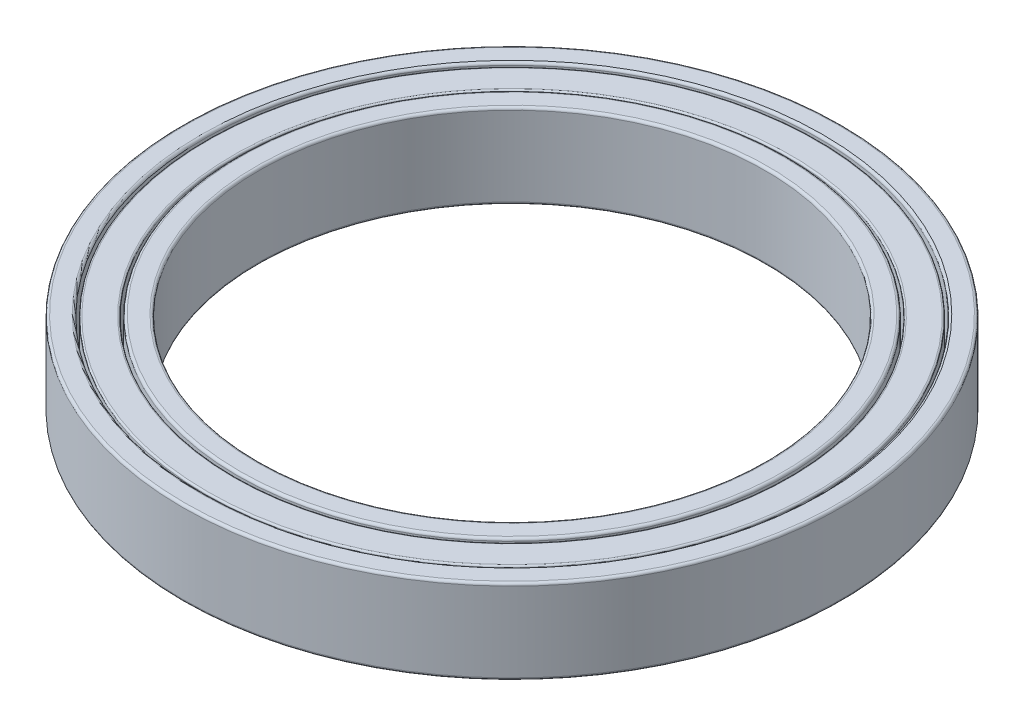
ISO-10303-21;
HEADER;
FILE_DESCRIPTION(('STEP AP214'),'2;1');
FILE_NAME('part.step','',(''),(''),'','','');
FILE_SCHEMA(('AUTOMOTIVE_DESIGN { 1 0 10303 214 1 1 1 1 }'));
ENDSEC;
DATA;
#1=APPLICATION_CONTEXT('core data for automotive mechanical design processes');
#2=APPLICATION_PROTOCOL_DEFINITION('international standard','automotive_design',2000,#1);
#3=PRODUCT_CONTEXT('',#1,'mechanical');
#4=PRODUCT('Part','Part','',(#3));
#5=PRODUCT_RELATED_PRODUCT_CATEGORY('part','',(#4));
#6=PRODUCT_DEFINITION_FORMATION('','',#4);
#7=PRODUCT_DEFINITION_CONTEXT('part definition',#1,'design');
#8=PRODUCT_DEFINITION('design','',#6,#7);
#9=PRODUCT_DEFINITION_SHAPE('','',#8);
#10=(LENGTH_UNIT() NAMED_UNIT(*) SI_UNIT(.MILLI.,.METRE.));
#11=(NAMED_UNIT(*) PLANE_ANGLE_UNIT() SI_UNIT($,.RADIAN.));
#12=(NAMED_UNIT(*) SI_UNIT($,.STERADIAN.) SOLID_ANGLE_UNIT());
#13=UNCERTAINTY_MEASURE_WITH_UNIT(LENGTH_MEASURE(1.E-05),#10,'distance_accuracy_value','');
#14=(GEOMETRIC_REPRESENTATION_CONTEXT(3) GLOBAL_UNCERTAINTY_ASSIGNED_CONTEXT((#13)) GLOBAL_UNIT_ASSIGNED_CONTEXT((#10,
#11,#12)) REPRESENTATION_CONTEXT('',''));
#15=CARTESIAN_POINT('',(0.,0.,0.));
#16=DIRECTION('',(0.,0.,1.));
#17=DIRECTION('',(1.,0.,0.));
#18=AXIS2_PLACEMENT_3D('',#15,#16,#17);
#19=CARTESIAN_POINT('',(0.,-102.389061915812,0.));
#20=DIRECTION('',(0.,1.,0.));
#21=DIRECTION('',(0.,0.,1.));
#22=AXIS2_PLACEMENT_3D('',#19,#20,#21);
#23=CYLINDRICAL_SURFACE('',#22,36.2);
#24=CARTESIAN_POINT('',(0.,0.399999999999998,0.));
#25=DIRECTION('',(0.,1.,0.));
#26=DIRECTION('',(0.,0.,1.));
#27=AXIS2_PLACEMENT_3D('',#24,#25,#26);
#28=CIRCLE('',#27,36.2);
#29=CARTESIAN_POINT('',(0.,0.399999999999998,36.2));
#30=VERTEX_POINT('',#29);
#31=EDGE_CURVE('E70',#30,#30,#28,.T.);
#32=ORIENTED_EDGE('',*,*,#31,.T.);
#33=EDGE_LOOP('',(#32));
#34=FACE_BOUND('',#33,.T.);
#35=CARTESIAN_POINT('',(0.,9.6,0.));
#36=DIRECTION('',(0.,1.,0.));
#37=DIRECTION('',(0.,0.,1.));
#38=AXIS2_PLACEMENT_3D('',#35,#36,#37);
#39=CIRCLE('',#38,36.2);
#40=CARTESIAN_POINT('',(0.,9.6,36.2));
#41=VERTEX_POINT('',#40);
#42=EDGE_CURVE('E74',#41,#41,#39,.F.);
#43=ORIENTED_EDGE('',*,*,#42,.T.);
#44=EDGE_LOOP('',(#43));
#45=FACE_BOUND('',#44,.T.);
#46=ADVANCED_FACE('F59',(#34,#45),#23,.T.);
#47=CARTESIAN_POINT('',(0.,9.8,0.));
#48=DIRECTION('',(0.,1.,0.));
#49=DIRECTION('',(0.,0.,1.));
#50=AXIS2_PLACEMENT_3D('',#47,#48,#49);
#51=PLANE('',#50);
#52=CARTESIAN_POINT('',(0.,9.8,0.));
#53=DIRECTION('',(0.,1.,0.));
#54=DIRECTION('',(0.,0.,1.));
#55=AXIS2_PLACEMENT_3D('',#52,#53,#54);
#56=CIRCLE('',#55,36.);
#57=CARTESIAN_POINT('',(0.,9.8,36.));
#58=VERTEX_POINT('',#57);
#59=EDGE_CURVE('E11',#58,#58,#56,.T.);
#60=ORIENTED_EDGE('',*,*,#59,.T.);
#61=EDGE_LOOP('',(#60));
#62=FACE_BOUND('',#61,.T.);
#63=CARTESIAN_POINT('',(0.,9.8,0.));
#64=DIRECTION('',(0.,1.,0.));
#65=DIRECTION('',(0.,0.,1.));
#66=AXIS2_PLACEMENT_3D('',#63,#64,#65);
#67=CIRCLE('',#66,33.);
#68=CARTESIAN_POINT('',(0.,9.8,33.));
#69=VERTEX_POINT('',#68);
#70=EDGE_CURVE('E66',#69,#69,#67,.F.);
#71=ORIENTED_EDGE('',*,*,#70,.T.);
#72=EDGE_LOOP('',(#71));
#73=FACE_BOUND('',#72,.T.);
#74=ADVANCED_FACE('F103',(#62,#73),#51,.T.);
#75=CARTESIAN_POINT('',(0.,-102.389061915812,0.));
#76=DIRECTION('',(0.,1.,0.));
#77=DIRECTION('',(0.,0.,1.));
#78=AXIS2_PLACEMENT_3D('',#75,#76,#77);
#79=CYLINDRICAL_SURFACE('',#78,32.8);
#80=CARTESIAN_POINT('',(0.,0.399999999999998,0.));
#81=DIRECTION('',(0.,1.,0.));
#82=DIRECTION('',(0.,0.,1.));
#83=AXIS2_PLACEMENT_3D('',#80,#81,#82);
#84=CIRCLE('',#83,32.8);
#85=CARTESIAN_POINT('',(0.,0.399999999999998,32.8));
#86=VERTEX_POINT('',#85);
#87=EDGE_CURVE('E85',#86,#86,#84,.F.);
#88=ORIENTED_EDGE('',*,*,#87,.T.);
#89=EDGE_LOOP('',(#88));
#90=FACE_BOUND('',#89,.T.);
#91=CARTESIAN_POINT('',(0.,9.6,0.));
#92=DIRECTION('',(0.,1.,0.));
#93=DIRECTION('',(0.,0.,1.));
#94=AXIS2_PLACEMENT_3D('',#91,#92,#93);
#95=CIRCLE('',#94,32.8);
#96=CARTESIAN_POINT('',(0.,9.6,32.8));
#97=VERTEX_POINT('',#96);
#98=EDGE_CURVE('E88',#97,#97,#95,.T.);
#99=ORIENTED_EDGE('',*,*,#98,.T.);
#100=EDGE_LOOP('',(#99));
#101=FACE_BOUND('',#100,.T.);
#102=ADVANCED_FACE('F92',(#90,#101),#79,.F.);
#103=CARTESIAN_POINT('',(0.,0.2,0.));
#104=DIRECTION('',(0.,1.,0.));
#105=DIRECTION('',(0.,0.,1.));
#106=AXIS2_PLACEMENT_3D('',#103,#104,#105);
#107=PLANE('',#106);
#108=CARTESIAN_POINT('',(0.,0.2,0.));
#109=DIRECTION('',(0.,1.,0.));
#110=DIRECTION('',(0.,0.,1.));
#111=AXIS2_PLACEMENT_3D('',#108,#109,#110);
#112=CIRCLE('',#111,33.);
#113=CARTESIAN_POINT('',(0.,0.2,33.));
#114=VERTEX_POINT('',#113);
#115=EDGE_CURVE('E79',#114,#114,#112,.T.);
#116=ORIENTED_EDGE('',*,*,#115,.T.);
#117=EDGE_LOOP('',(#116));
#118=FACE_BOUND('',#117,.T.);
#119=CARTESIAN_POINT('',(0.,0.2,0.));
#120=DIRECTION('',(0.,1.,0.));
#121=DIRECTION('',(0.,0.,1.));
#122=AXIS2_PLACEMENT_3D('',#119,#120,#121);
#123=CIRCLE('',#122,36.);
#124=CARTESIAN_POINT('',(0.,0.2,36.));
#125=VERTEX_POINT('',#124);
#126=EDGE_CURVE('E82',#125,#125,#123,.F.);
#127=ORIENTED_EDGE('',*,*,#126,.T.);
#128=EDGE_LOOP('',(#127));
#129=FACE_BOUND('',#128,.T.);
#130=ADVANCED_FACE('F116',(#118,#129),#107,.F.);
#131=CARTESIAN_POINT('',(0.,0.399999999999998,0.));
#132=DIRECTION('',(0.,1.,0.));
#133=DIRECTION('',(0.,0.,1.));
#134=AXIS2_PLACEMENT_3D('',#131,#132,#133);
#135=TOROIDAL_SURFACE('',#134,33.,0.2);
#136=ORIENTED_EDGE('',*,*,#115,.F.);
#137=EDGE_LOOP('',(#136));
#138=FACE_BOUND('',#137,.T.);
#139=ORIENTED_EDGE('',*,*,#87,.F.);
#140=EDGE_LOOP('',(#139));
#141=FACE_BOUND('',#140,.T.);
#142=ADVANCED_FACE('F113',(#138,#141),#135,.T.);
#143=CARTESIAN_POINT('',(0.,0.399999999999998,0.));
#144=DIRECTION('',(0.,1.,0.));
#145=DIRECTION('',(0.,0.,1.));
#146=AXIS2_PLACEMENT_3D('',#143,#144,#145);
#147=TOROIDAL_SURFACE('',#146,36.,0.2);
#148=ORIENTED_EDGE('',*,*,#31,.F.);
#149=EDGE_LOOP('',(#148));
#150=FACE_BOUND('',#149,.T.);
#151=ORIENTED_EDGE('',*,*,#126,.F.);
#152=EDGE_LOOP('',(#151));
#153=FACE_BOUND('',#152,.T.);
#154=ADVANCED_FACE('F100',(#150,#153),#147,.T.);
#155=CARTESIAN_POINT('',(0.,9.6,0.));
#156=DIRECTION('',(0.,1.,0.));
#157=DIRECTION('',(0.,0.,1.));
#158=AXIS2_PLACEMENT_3D('',#155,#156,#157);
#159=TOROIDAL_SURFACE('',#158,36.,0.2);
#160=ORIENTED_EDGE('',*,*,#42,.F.);
#161=EDGE_LOOP('',(#160));
#162=FACE_BOUND('',#161,.T.);
#163=ORIENTED_EDGE('',*,*,#59,.F.);
#164=EDGE_LOOP('',(#163));
#165=FACE_BOUND('',#164,.T.);
#166=ADVANCED_FACE('F95',(#162,#165),#159,.T.);
#167=CARTESIAN_POINT('',(0.,9.6,0.));
#168=DIRECTION('',(0.,1.,0.));
#169=DIRECTION('',(0.,0.,1.));
#170=AXIS2_PLACEMENT_3D('',#167,#168,#169);
#171=TOROIDAL_SURFACE('',#170,33.,0.2);
#172=ORIENTED_EDGE('',*,*,#70,.F.);
#173=EDGE_LOOP('',(#172));
#174=FACE_BOUND('',#173,.T.);
#175=ORIENTED_EDGE('',*,*,#98,.F.);
#176=EDGE_LOOP('',(#175));
#177=FACE_BOUND('',#176,.T.);
#178=ADVANCED_FACE('F61',(#174,#177),#171,.T.);
#179=CLOSED_SHELL('',(#46,#74,#102,#130,#142,#154,#166,#178));
#180=MANIFOLD_SOLID_BREP('B2',#179);
#181=CARTESIAN_POINT('',(0.,120.308657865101,0.));
#182=DIRECTION('',(0.,-1.,0.));
#183=DIRECTION('',(0.,0.,-1.));
#184=AXIS2_PLACEMENT_3D('',#181,#182,#183);
#185=CYLINDRICAL_SURFACE('',#184,39.);
#186=CARTESIAN_POINT('',(0.,0.299999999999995,0.));
#187=DIRECTION('',(0.,1.,0.));
#188=DIRECTION('',(0.,0.,1.));
#189=AXIS2_PLACEMENT_3D('',#186,#187,#188);
#190=CIRCLE('',#189,39.);
#191=CARTESIAN_POINT('',(0.,0.299999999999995,39.));
#192=VERTEX_POINT('',#191);
#193=EDGE_CURVE('E58',#192,#192,#190,.T.);
#194=ORIENTED_EDGE('',*,*,#193,.T.);
#195=EDGE_LOOP('',(#194));
#196=FACE_BOUND('',#195,.T.);
#197=CARTESIAN_POINT('',(0.,9.7,0.));
#198=DIRECTION('',(0.,1.,0.));
#199=DIRECTION('',(0.,0.,1.));
#200=AXIS2_PLACEMENT_3D('',#197,#198,#199);
#201=CIRCLE('',#200,39.);
#202=CARTESIAN_POINT('',(0.,9.7,39.));
#203=VERTEX_POINT('',#202);
#204=EDGE_CURVE('E196',#203,#203,#201,.F.);
#205=ORIENTED_EDGE('',*,*,#204,.T.);
#206=EDGE_LOOP('',(#205));
#207=FACE_BOUND('',#206,.T.);
#208=ADVANCED_FACE('F189',(#196,#207),#185,.T.);
#209=CARTESIAN_POINT('',(0.,0.,0.));
#210=DIRECTION('',(0.,1.,0.));
#211=DIRECTION('',(0.,0.,1.));
#212=AXIS2_PLACEMENT_3D('',#209,#210,#211);
#213=PLANE('',#212);
#214=CARTESIAN_POINT('',(0.,0.,0.));
#215=DIRECTION('',(0.,1.,0.));
#216=DIRECTION('',(0.,0.,1.));
#217=AXIS2_PLACEMENT_3D('',#214,#215,#216);
#218=CIRCLE('',#217,36.8);
#219=CARTESIAN_POINT('',(0.,0.,36.8));
#220=VERTEX_POINT('',#219);
#221=EDGE_CURVE('E215',#220,#220,#218,.T.);
#222=ORIENTED_EDGE('',*,*,#221,.T.);
#223=EDGE_LOOP('',(#222));
#224=FACE_BOUND('',#223,.T.);
#225=CARTESIAN_POINT('',(0.,0.,0.));
#226=DIRECTION('',(0.,1.,0.));
#227=DIRECTION('',(0.,0.,1.));
#228=AXIS2_PLACEMENT_3D('',#225,#226,#227);
#229=CIRCLE('',#228,38.7);
#230=CARTESIAN_POINT('',(0.,0.,38.7));
#231=VERTEX_POINT('',#230);
#232=EDGE_CURVE('E218',#231,#231,#229,.F.);
#233=ORIENTED_EDGE('',*,*,#232,.T.);
#234=EDGE_LOOP('',(#233));
#235=FACE_BOUND('',#234,.T.);
#236=ADVANCED_FACE('F222',(#224,#235),#213,.F.);
#237=CARTESIAN_POINT('',(0.,120.308657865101,0.));
#238=DIRECTION('',(0.,-1.,0.));
#239=DIRECTION('',(0.,0.,-1.));
#240=AXIS2_PLACEMENT_3D('',#237,#238,#239);
#241=CYLINDRICAL_SURFACE('',#240,36.5);
#242=CARTESIAN_POINT('',(0.,0.299999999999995,0.));
#243=DIRECTION('',(0.,1.,0.));
#244=DIRECTION('',(0.,0.,1.));
#245=AXIS2_PLACEMENT_3D('',#242,#243,#244);
#246=CIRCLE('',#245,36.5);
#247=CARTESIAN_POINT('',(0.,0.299999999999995,36.5));
#248=VERTEX_POINT('',#247);
#249=EDGE_CURVE('E209',#248,#248,#246,.F.);
#250=ORIENTED_EDGE('',*,*,#249,.T.);
#251=EDGE_LOOP('',(#250));
#252=FACE_BOUND('',#251,.T.);
#253=CARTESIAN_POINT('',(0.,9.7,0.));
#254=DIRECTION('',(0.,1.,0.));
#255=DIRECTION('',(0.,0.,1.));
#256=AXIS2_PLACEMENT_3D('',#253,#254,#255);
#257=CIRCLE('',#256,36.5);
#258=CARTESIAN_POINT('',(0.,9.7,36.5));
#259=VERTEX_POINT('',#258);
#260=EDGE_CURVE('E212',#259,#259,#257,.T.);
#261=ORIENTED_EDGE('',*,*,#260,.T.);
#262=EDGE_LOOP('',(#261));
#263=FACE_BOUND('',#262,.T.);
#264=ADVANCED_FACE('F241',(#252,#263),#241,.F.);
#265=CARTESIAN_POINT('',(0.,10.,0.));
#266=DIRECTION('',(0.,1.,0.));
#267=DIRECTION('',(0.,0.,1.));
#268=AXIS2_PLACEMENT_3D('',#265,#266,#267);
#269=PLANE('',#268);
#270=CARTESIAN_POINT('',(0.,10.,0.));
#271=DIRECTION('',(0.,1.,0.));
#272=DIRECTION('',(0.,0.,1.));
#273=AXIS2_PLACEMENT_3D('',#270,#271,#272);
#274=CIRCLE('',#273,36.8);
#275=CARTESIAN_POINT('',(0.,10.,36.8));
#276=VERTEX_POINT('',#275);
#277=EDGE_CURVE('E200',#276,#276,#274,.F.);
#278=ORIENTED_EDGE('',*,*,#277,.T.);
#279=EDGE_LOOP('',(#278));
#280=FACE_BOUND('',#279,.T.);
#281=CARTESIAN_POINT('',(0.,10.,0.));
#282=DIRECTION('',(0.,1.,0.));
#283=DIRECTION('',(0.,0.,1.));
#284=AXIS2_PLACEMENT_3D('',#281,#282,#283);
#285=CIRCLE('',#284,38.7);
#286=CARTESIAN_POINT('',(0.,10.,38.7));
#287=VERTEX_POINT('',#286);
#288=EDGE_CURVE('E204',#287,#287,#285,.T.);
#289=ORIENTED_EDGE('',*,*,#288,.T.);
#290=EDGE_LOOP('',(#289));
#291=FACE_BOUND('',#290,.T.);
#292=ADVANCED_FACE('F247',(#280,#291),#269,.T.);
#293=CARTESIAN_POINT('',(0.,0.299999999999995,0.));
#294=DIRECTION('',(0.,1.,0.));
#295=DIRECTION('',(0.,0.,1.));
#296=AXIS2_PLACEMENT_3D('',#293,#294,#295);
#297=TOROIDAL_SURFACE('',#296,36.8,0.3);
#298=ORIENTED_EDGE('',*,*,#249,.F.);
#299=EDGE_LOOP('',(#298));
#300=FACE_BOUND('',#299,.T.);
#301=ORIENTED_EDGE('',*,*,#221,.F.);
#302=EDGE_LOOP('',(#301));
#303=FACE_BOUND('',#302,.T.);
#304=ADVANCED_FACE('F233',(#300,#303),#297,.T.);
#305=CARTESIAN_POINT('',(0.,9.7,0.));
#306=DIRECTION('',(0.,1.,0.));
#307=DIRECTION('',(0.,0.,1.));
#308=AXIS2_PLACEMENT_3D('',#305,#306,#307);
#309=TOROIDAL_SURFACE('',#308,36.8,0.3);
#310=ORIENTED_EDGE('',*,*,#277,.F.);
#311=EDGE_LOOP('',(#310));
#312=FACE_BOUND('',#311,.T.);
#313=ORIENTED_EDGE('',*,*,#260,.F.);
#314=EDGE_LOOP('',(#313));
#315=FACE_BOUND('',#314,.T.);
#316=ADVANCED_FACE('F227',(#312,#315),#309,.T.);
#317=CARTESIAN_POINT('',(0.,0.299999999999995,0.));
#318=DIRECTION('',(0.,1.,0.));
#319=DIRECTION('',(0.,0.,1.));
#320=AXIS2_PLACEMENT_3D('',#317,#318,#319);
#321=TOROIDAL_SURFACE('',#320,38.7,0.3);
#322=ORIENTED_EDGE('',*,*,#232,.F.);
#323=EDGE_LOOP('',(#322));
#324=FACE_BOUND('',#323,.T.);
#325=ORIENTED_EDGE('',*,*,#193,.F.);
#326=EDGE_LOOP('',(#325));
#327=FACE_BOUND('',#326,.T.);
#328=ADVANCED_FACE('F224',(#324,#327),#321,.T.);
#329=CARTESIAN_POINT('',(0.,9.7,0.));
#330=DIRECTION('',(0.,1.,0.));
#331=DIRECTION('',(0.,0.,1.));
#332=AXIS2_PLACEMENT_3D('',#329,#330,#331);
#333=TOROIDAL_SURFACE('',#332,38.7,0.3);
#334=ORIENTED_EDGE('',*,*,#204,.F.);
#335=EDGE_LOOP('',(#334));
#336=FACE_BOUND('',#335,.T.);
#337=ORIENTED_EDGE('',*,*,#288,.F.);
#338=EDGE_LOOP('',(#337));
#339=FACE_BOUND('',#338,.T.);
#340=ADVANCED_FACE('F191',(#336,#339),#333,.T.);
#341=CLOSED_SHELL('',(#208,#236,#264,#292,#304,#316,#328,#340));
#342=MANIFOLD_SOLID_BREP('B6',#341);
#343=CARTESIAN_POINT('',(0.,10.,0.));
#344=DIRECTION('',(0.,1.,0.));
#345=DIRECTION('',(0.,0.,1.));
#346=AXIS2_PLACEMENT_3D('',#343,#344,#345);
#347=PLANE('',#346);
#348=CARTESIAN_POINT('',(0.,10.,0.));
#349=DIRECTION('',(0.,1.,0.));
#350=DIRECTION('',(0.,0.,1.));
#351=AXIS2_PLACEMENT_3D('',#348,#349,#350);
#352=CIRCLE('',#351,30.3);
#353=CARTESIAN_POINT('',(0.,10.,30.3));
#354=VERTEX_POINT('',#353);
#355=EDGE_CURVE('E188',#354,#354,#352,.F.);
#356=ORIENTED_EDGE('',*,*,#355,.T.);
#357=EDGE_LOOP('',(#356));
#358=FACE_BOUND('',#357,.T.);
#359=CARTESIAN_POINT('',(0.,10.,0.));
#360=DIRECTION('',(0.,1.,0.));
#361=DIRECTION('',(0.,0.,1.));
#362=AXIS2_PLACEMENT_3D('',#359,#360,#361);
#363=CIRCLE('',#362,32.2);
#364=CARTESIAN_POINT('',(0.,10.,32.2));
#365=VERTEX_POINT('',#364);
#366=EDGE_CURVE('E318',#365,#365,#363,.T.);
#367=ORIENTED_EDGE('',*,*,#366,.T.);
#368=EDGE_LOOP('',(#367));
#369=FACE_BOUND('',#368,.T.);
#370=ADVANCED_FACE('F311',(#358,#369),#347,.T.);
#371=CARTESIAN_POINT('',(0.,0.,0.));
#372=DIRECTION('',(0.,1.,0.));
#373=DIRECTION('',(0.,0.,1.));
#374=AXIS2_PLACEMENT_3D('',#371,#372,#373);
#375=PLANE('',#374);
#376=CARTESIAN_POINT('',(0.,0.,0.));
#377=DIRECTION('',(0.,1.,0.));
#378=DIRECTION('',(0.,0.,1.));
#379=AXIS2_PLACEMENT_3D('',#376,#377,#378);
#380=CIRCLE('',#379,30.3);
#381=CARTESIAN_POINT('',(0.,0.,30.3));
#382=VERTEX_POINT('',#381);
#383=EDGE_CURVE('E337',#382,#382,#380,.T.);
#384=ORIENTED_EDGE('',*,*,#383,.T.);
#385=EDGE_LOOP('',(#384));
#386=FACE_BOUND('',#385,.T.);
#387=CARTESIAN_POINT('',(0.,0.,0.));
#388=DIRECTION('',(0.,1.,0.));
#389=DIRECTION('',(0.,0.,1.));
#390=AXIS2_PLACEMENT_3D('',#387,#388,#389);
#391=CIRCLE('',#390,32.2);
#392=CARTESIAN_POINT('',(0.,0.,32.2));
#393=VERTEX_POINT('',#392);
#394=EDGE_CURVE('E340',#393,#393,#391,.F.);
#395=ORIENTED_EDGE('',*,*,#394,.T.);
#396=EDGE_LOOP('',(#395));
#397=FACE_BOUND('',#396,.T.);
#398=ADVANCED_FACE('F344',(#386,#397),#375,.F.);
#399=CARTESIAN_POINT('',(0.,10.,0.));
#400=DIRECTION('',(0.,-1.,0.));
#401=DIRECTION('',(0.,0.,-1.));
#402=AXIS2_PLACEMENT_3D('',#399,#400,#401);
#403=CYLINDRICAL_SURFACE('',#402,32.5);
#404=CARTESIAN_POINT('',(0.,0.3,0.));
#405=DIRECTION('',(0.,1.,0.));
#406=DIRECTION('',(0.,0.,1.));
#407=AXIS2_PLACEMENT_3D('',#404,#405,#406);
#408=CIRCLE('',#407,32.5);
#409=CARTESIAN_POINT('',(0.,0.3,32.5));
#410=VERTEX_POINT('',#409);
#411=EDGE_CURVE('E322',#410,#410,#408,.T.);
#412=ORIENTED_EDGE('',*,*,#411,.T.);
#413=EDGE_LOOP('',(#412));
#414=FACE_BOUND('',#413,.T.);
#415=CARTESIAN_POINT('',(0.,9.7,0.));
#416=DIRECTION('',(0.,1.,0.));
#417=DIRECTION('',(0.,0.,1.));
#418=AXIS2_PLACEMENT_3D('',#415,#416,#417);
#419=CIRCLE('',#418,32.5);
#420=CARTESIAN_POINT('',(0.,9.7,32.5));
#421=VERTEX_POINT('',#420);
#422=EDGE_CURVE('E326',#421,#421,#419,.F.);
#423=ORIENTED_EDGE('',*,*,#422,.T.);
#424=EDGE_LOOP('',(#423));
#425=FACE_BOUND('',#424,.T.);
#426=ADVANCED_FACE('F354',(#414,#425),#403,.T.);
#427=CARTESIAN_POINT('',(0.,10.,0.));
#428=DIRECTION('',(0.,-1.,0.));
#429=DIRECTION('',(0.,0.,-1.));
#430=AXIS2_PLACEMENT_3D('',#427,#428,#429);
#431=CYLINDRICAL_SURFACE('',#430,30.);
#432=CARTESIAN_POINT('',(0.,0.3,0.));
#433=DIRECTION('',(0.,1.,0.));
#434=DIRECTION('',(0.,0.,1.));
#435=AXIS2_PLACEMENT_3D('',#432,#433,#434);
#436=CIRCLE('',#435,30.);
#437=CARTESIAN_POINT('',(0.,0.3,30.));
#438=VERTEX_POINT('',#437);
#439=EDGE_CURVE('E331',#438,#438,#436,.F.);
#440=ORIENTED_EDGE('',*,*,#439,.T.);
#441=EDGE_LOOP('',(#440));
#442=FACE_BOUND('',#441,.T.);
#443=CARTESIAN_POINT('',(0.,9.7,0.));
#444=DIRECTION('',(0.,1.,0.));
#445=DIRECTION('',(0.,0.,1.));
#446=AXIS2_PLACEMENT_3D('',#443,#444,#445);
#447=CIRCLE('',#446,30.);
#448=CARTESIAN_POINT('',(0.,9.7,30.));
#449=VERTEX_POINT('',#448);
#450=EDGE_CURVE('E334',#449,#449,#447,.T.);
#451=ORIENTED_EDGE('',*,*,#450,.T.);
#452=EDGE_LOOP('',(#451));
#453=FACE_BOUND('',#452,.T.);
#454=ADVANCED_FACE('F357',(#442,#453),#431,.F.);
#455=CARTESIAN_POINT('',(0.,0.3,0.));
#456=DIRECTION('',(0.,1.,0.));
#457=DIRECTION('',(0.,0.,1.));
#458=AXIS2_PLACEMENT_3D('',#455,#456,#457);
#459=TOROIDAL_SURFACE('',#458,30.3,0.3);
#460=ORIENTED_EDGE('',*,*,#439,.F.);
#461=EDGE_LOOP('',(#460));
#462=FACE_BOUND('',#461,.T.);
#463=ORIENTED_EDGE('',*,*,#383,.F.);
#464=EDGE_LOOP('',(#463));
#465=FACE_BOUND('',#464,.T.);
#466=ADVANCED_FACE('F350',(#462,#465),#459,.T.);
#467=CARTESIAN_POINT('',(0.,0.3,0.));
#468=DIRECTION('',(0.,1.,0.));
#469=DIRECTION('',(0.,0.,1.));
#470=AXIS2_PLACEMENT_3D('',#467,#468,#469);
#471=TOROIDAL_SURFACE('',#470,32.2,0.3);
#472=ORIENTED_EDGE('',*,*,#394,.F.);
#473=EDGE_LOOP('',(#472));
#474=FACE_BOUND('',#473,.T.);
#475=ORIENTED_EDGE('',*,*,#411,.F.);
#476=EDGE_LOOP('',(#475));
#477=FACE_BOUND('',#476,.T.);
#478=ADVANCED_FACE('F346',(#474,#477),#471,.T.);
#479=CARTESIAN_POINT('',(0.,9.7,0.));
#480=DIRECTION('',(0.,1.,0.));
#481=DIRECTION('',(0.,0.,1.));
#482=AXIS2_PLACEMENT_3D('',#479,#480,#481);
#483=TOROIDAL_SURFACE('',#482,30.3,0.3);
#484=ORIENTED_EDGE('',*,*,#355,.F.);
#485=EDGE_LOOP('',(#484));
#486=FACE_BOUND('',#485,.T.);
#487=ORIENTED_EDGE('',*,*,#450,.F.);
#488=EDGE_LOOP('',(#487));
#489=FACE_BOUND('',#488,.T.);
#490=ADVANCED_FACE('F349',(#486,#489),#483,.T.);
#491=CARTESIAN_POINT('',(0.,9.7,0.));
#492=DIRECTION('',(0.,1.,0.));
#493=DIRECTION('',(0.,0.,1.));
#494=AXIS2_PLACEMENT_3D('',#491,#492,#493);
#495=TOROIDAL_SURFACE('',#494,32.2,0.3);
#496=ORIENTED_EDGE('',*,*,#422,.F.);
#497=EDGE_LOOP('',(#496));
#498=FACE_BOUND('',#497,.T.);
#499=ORIENTED_EDGE('',*,*,#366,.F.);
#500=EDGE_LOOP('',(#499));
#501=FACE_BOUND('',#500,.T.);
#502=ADVANCED_FACE('F313',(#498,#501),#495,.T.);
#503=CLOSED_SHELL('',(#370,#398,#426,#454,#466,#478,#490,#502));
#504=MANIFOLD_SOLID_BREP('B53',#503);
#505=ADVANCED_BREP_SHAPE_REPRESENTATION('',(#18,#180,#342,#504),#14);
#506=SHAPE_DEFINITION_REPRESENTATION(#9,#505);
ENDSEC;
END-ISO-10303-21;
